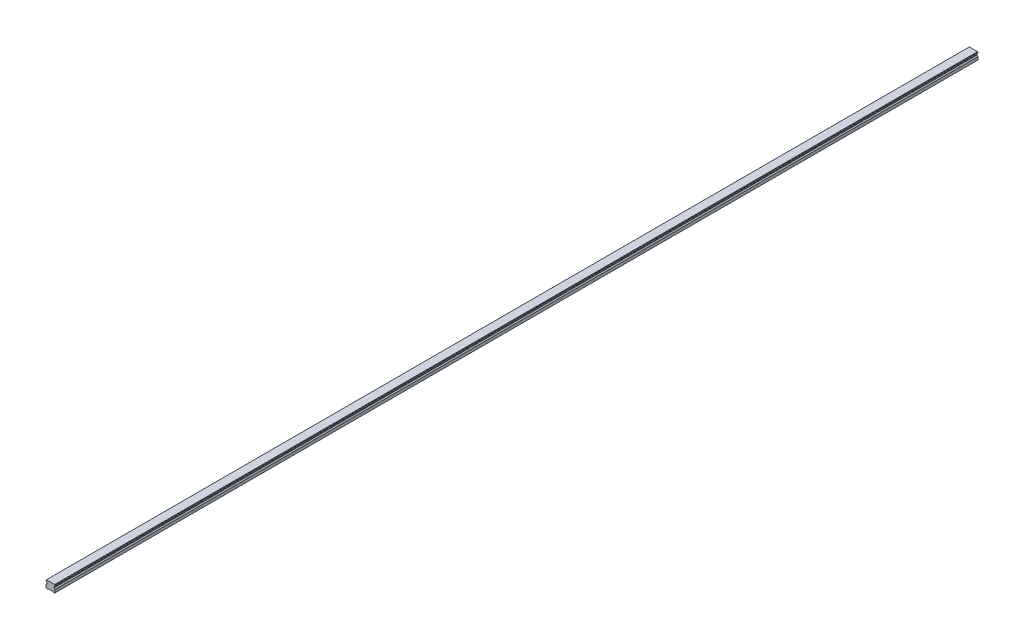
from build123d import *

# Parameters (mm, degrees)
SKETCH1_W           = 20
SKETCH1_H           = 16.3
BOSS_EXTRUDE1_DEPTH = 1010
CUT_EXTRUDE1_DEPTH  = 2021.090515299
CHAMFER1_SIZE       = 1
FILLET1_R           = 1
CUT_EXTRUDE2_DEPTH  = 2021.090515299
SKETCH5_R           = 3
SKETCH5_R_2         = 2.5
CUT_EXTRUDE5_DEPTH  = 10
SKETCH5_2_R         = 2.5
CUT_EXTRUDE6_DEPTH  = 13
LPATTERN2_COUNT     = 34
LPATTERN2_PITCH     = 60


with BuildPart() as part:
    # Sketch1 → Boss-Extrude1 (new, symmetric)
    with BuildSketch(Plane.XY):
        with Locations((0, 8.15)):
            Rectangle(SKETCH1_W, SKETCH1_H)
    extrude(amount=BOSS_EXTRUDE1_DEPTH, both=True)

    # Sketch2 → Cut-Extrude1 (cut, through all)
    with BuildSketch(Plane.XY.offset(1010)):
        Polygon((-10, 14.3), (-10, 7.3), (-7.666666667, 9.633333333), (-7.666666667, 11.966666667), align=None)
        Polygon((7.666666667, 11.966666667), (10, 14.3), (10, 7.3), (7.666666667, 9.633333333), align=None)
    extrude(amount=-CUT_EXTRUDE1_DEPTH, mode=Mode.SUBTRACT)

    # Chamfer1
    chamfer1_edges = [part.edges().sort_by_distance(p)[0] for p in [
        (-10, 16.3, 0),
        (10, 16.3, 0),
        (10, 0, 0),
        (-10, 0, 0),
    ]]
    chamfer(chamfer1_edges, length=CHAMFER1_SIZE)

    # Fillet1
    fillet1_edges = [part.edges().sort_by_distance(p)[0] for p in [
        (-7.666666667, 11.966666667, 0),
        (-7.666666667, 9.633333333, 0),
        (7.666666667, 9.633333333, 0),
        (7.666666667, 11.966666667, 0),
    ]]
    fillet(fillet1_edges, radius=FILLET1_R)

    # Sketch3 → Cut-Extrude2 (cut, through all)
    with BuildSketch(Plane.XY.offset(1010)):
        Polygon((-6, 0), (-5, 1), (5, 1), (6, 0), align=None)
    extrude(amount=-CUT_EXTRUDE2_DEPTH, mode=Mode.SUBTRACT)

    # Sketch5 → Cut-Extrude5 (cut)
    with BuildSketch(Plane.XZ.offset(-1)):
        with Locations(Location((0, 990, 0), (0, 0, 270))):
            Circle(SKETCH5_R)
        with Locations(Location((0, 990, 0), (0, 0, 270))):
            Circle(SKETCH5_R_2, mode=Mode.SUBTRACT)
    cut_extrude5 = extrude(amount=-CUT_EXTRUDE5_DEPTH, mode=Mode.SUBTRACT)

    # Sketch5_2 → Cut-Extrude6 (cut)
    with BuildSketch(Plane.XZ.offset(-1)):
        with Locations(Location((0, 990, 0), (0, 0, 270))):
            Circle(SKETCH5_2_R)
    cut_extrude6 = extrude(amount=-CUT_EXTRUDE6_DEPTH, mode=Mode.SUBTRACT)

    # Cut-Extrude7 cone 1 section (on through the dimple's axis) → Cut-Extrude7 (revolve, cut)
    with BuildSketch(Plane(origin=(0, 14, 990), x_dir=(0, 0, -1), z_dir=(1, 0, 0))):
        Polygon((0, 0), (2.5, 0), (0, 1.443375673), align=None)
    cut_extrude7 = revolve(axis=Axis((0, 14, 990), (0, 1, 0)), mode=Mode.SUBTRACT)

    # LPattern2: Cut-Extrude5, Cut-Extrude6, Cut-Extrude7 ×34
    with Locations(*[(0, 0, -i * LPATTERN2_PITCH) for i in range(1, LPATTERN2_COUNT)]):
        add(cut_extrude5, mode=Mode.SUBTRACT)
        add(cut_extrude6, mode=Mode.SUBTRACT)
        add(cut_extrude7, mode=Mode.SUBTRACT)


solid = part.part
